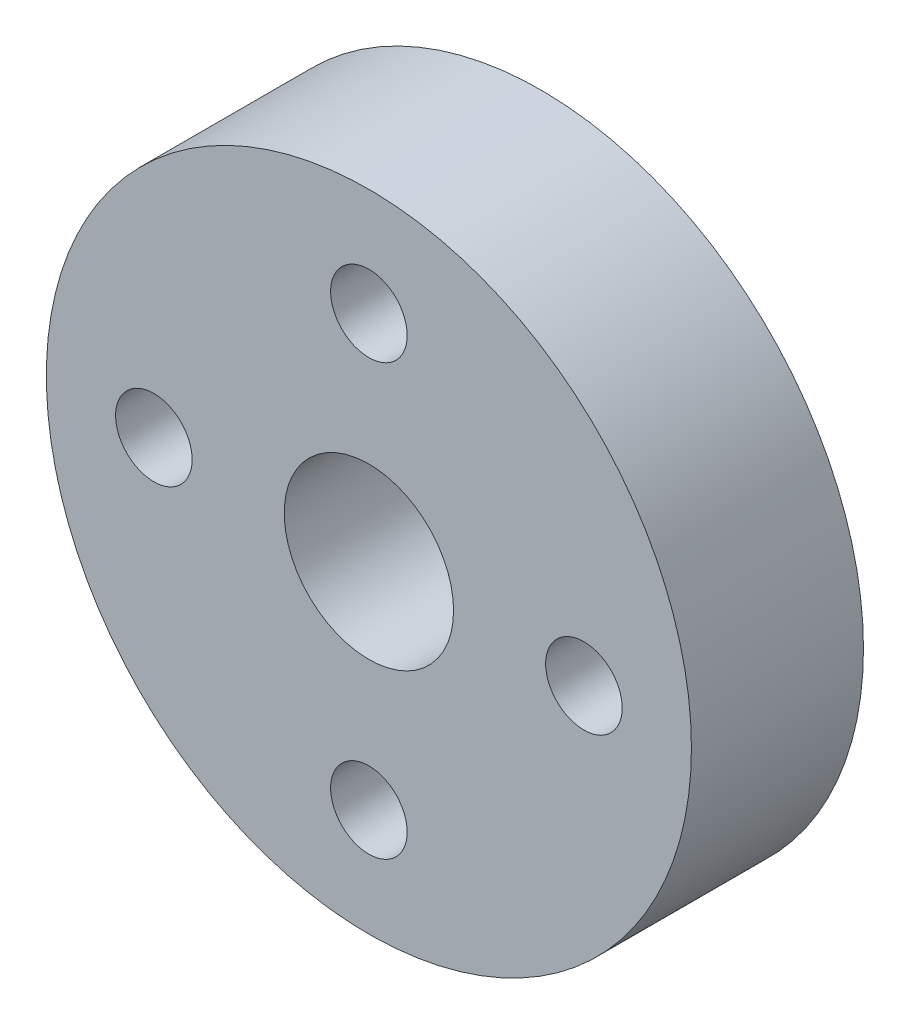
from build123d import *

# Parameters (mm, degrees)
SKETCH1_R                 = 9.525
SKETCH1_R_2               = 2.5
BOSS_EXTRUDE1_DEPTH       = 5.08
TAP_DRILL_FOR_4_40_TAP1_D = 2.2606


with BuildPart() as part:
    # Sketch1 → Boss-Extrude1 (new body)
    with BuildSketch(Plane.XY):
        Circle(SKETCH1_R)
        Circle(SKETCH1_R_2, mode=Mode.SUBTRACT)
    extrude(amount=BOSS_EXTRUDE1_DEPTH)

    # Tap Drill for _4-40 Tap1 (through all)
    with Locations(Plane.XY.offset(5.08)):
        with Locations((0, 6.35), (6.35, 0), (0, -6.35), (-6.35, 0)):
            Hole(TAP_DRILL_FOR_4_40_TAP1_D / 2)


solid = part.part
